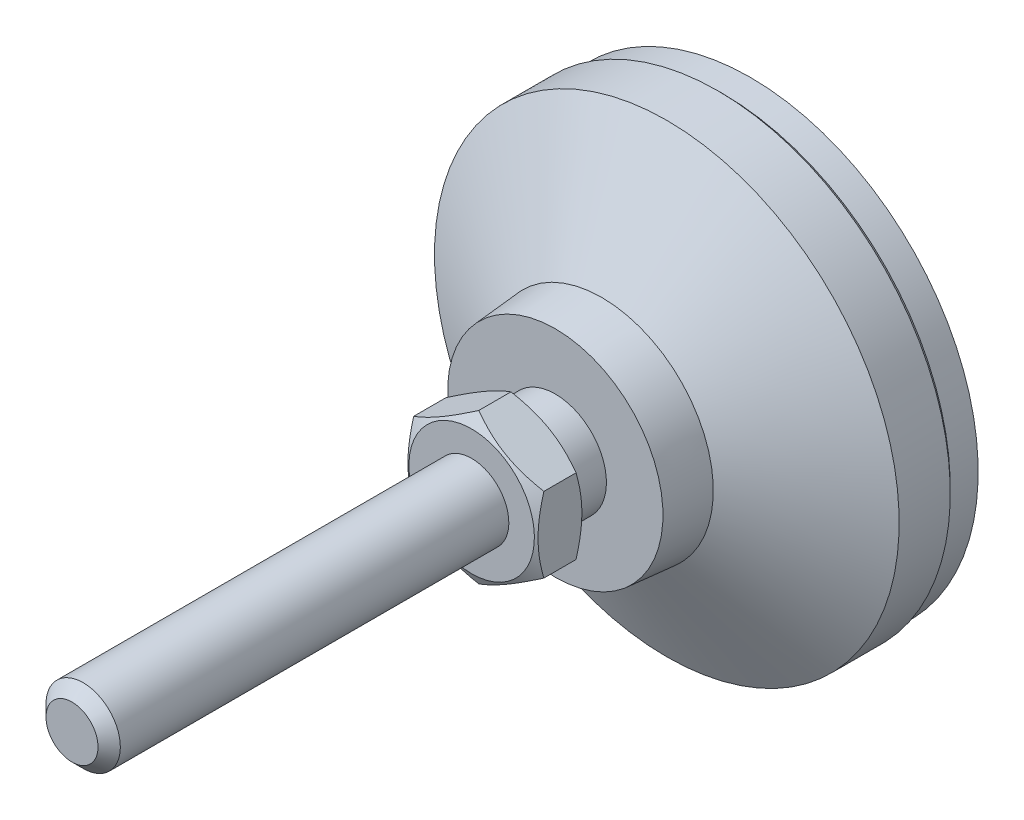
ISO-10303-21;
HEADER;
FILE_DESCRIPTION(('STEP AP214'),'2;1');
FILE_NAME('part.step','',(''),(''),'','','');
FILE_SCHEMA(('AUTOMOTIVE_DESIGN { 1 0 10303 214 1 1 1 1 }'));
ENDSEC;
DATA;
#1=APPLICATION_CONTEXT('core data for automotive mechanical design processes');
#2=APPLICATION_PROTOCOL_DEFINITION('international standard','automotive_design',2000,#1);
#3=PRODUCT_CONTEXT('',#1,'mechanical');
#4=PRODUCT('Part','Part','',(#3));
#5=PRODUCT_RELATED_PRODUCT_CATEGORY('part','',(#4));
#6=PRODUCT_DEFINITION_FORMATION('','',#4);
#7=PRODUCT_DEFINITION_CONTEXT('part definition',#1,'design');
#8=PRODUCT_DEFINITION('design','',#6,#7);
#9=PRODUCT_DEFINITION_SHAPE('','',#8);
#10=(LENGTH_UNIT() NAMED_UNIT(*) SI_UNIT(.MILLI.,.METRE.));
#11=(NAMED_UNIT(*) PLANE_ANGLE_UNIT() SI_UNIT($,.RADIAN.));
#12=(NAMED_UNIT(*) SI_UNIT($,.STERADIAN.) SOLID_ANGLE_UNIT());
#13=UNCERTAINTY_MEASURE_WITH_UNIT(LENGTH_MEASURE(1.E-05),#10,'distance_accuracy_value','');
#14=(GEOMETRIC_REPRESENTATION_CONTEXT(3) GLOBAL_UNCERTAINTY_ASSIGNED_CONTEXT((#13)) GLOBAL_UNIT_ASSIGNED_CONTEXT((#10,
#11,#12)) REPRESENTATION_CONTEXT('',''));
#15=CARTESIAN_POINT('',(0.,0.,0.));
#16=DIRECTION('',(0.,0.,1.));
#17=DIRECTION('',(1.,0.,0.));
#18=AXIS2_PLACEMENT_3D('',#15,#16,#17);
#19=CARTESIAN_POINT('',(0.,0.,2.));
#20=DIRECTION('',(0.,0.,-1.));
#21=DIRECTION('',(0.,1.,0.));
#22=AXIS2_PLACEMENT_3D('',#19,#20,#21);
#23=CYLINDRICAL_SURFACE('',#22,5.49999999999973);
#24=CARTESIAN_POINT('',(0.,0.,25.));
#25=DIRECTION('',(0.,0.,-1.));
#26=DIRECTION('',(0.,1.,0.));
#27=AXIS2_PLACEMENT_3D('',#24,#25,#26);
#28=CIRCLE('',#27,5.49999999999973);
#29=CARTESIAN_POINT('',(0.,5.49999999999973,25.));
#30=VERTEX_POINT('',#29);
#31=EDGE_CURVE('E106',#30,#30,#28,.T.);
#32=ORIENTED_EDGE('',*,*,#31,.T.);
#33=EDGE_LOOP('',(#32));
#34=FACE_BOUND('',#33,.T.);
#35=CARTESIAN_POINT('',(0.,0.,21.));
#36=DIRECTION('',(0.,0.,-1.));
#37=DIRECTION('',(0.,1.,0.));
#38=AXIS2_PLACEMENT_3D('',#35,#36,#37);
#39=CIRCLE('',#38,5.49999999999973);
#40=CARTESIAN_POINT('',(0.,5.49999999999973,21.));
#41=VERTEX_POINT('',#40);
#42=EDGE_CURVE('E93',#41,#41,#39,.T.);
#43=ORIENTED_EDGE('',*,*,#42,.F.);
#44=EDGE_LOOP('',(#43));
#45=FACE_BOUND('',#44,.T.);
#46=ADVANCED_FACE('F14',(#34,#45),#23,.T.);
#47=CARTESIAN_POINT('',(-5.49999999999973,0.,25.));
#48=DIRECTION('',(0.,0.,1.));
#49=DIRECTION('',(0.,-1.,0.));
#50=AXIS2_PLACEMENT_3D('',#47,#48,#49);
#51=PLANE('',#50);
#52=CARTESIAN_POINT('',(0.,0.,25.));
#53=DIRECTION('',(0.,0.,1.));
#54=DIRECTION('',(0.,-1.,0.));
#55=AXIS2_PLACEMENT_3D('',#52,#53,#54);
#56=CIRCLE('',#55,6.75);
#57=CARTESIAN_POINT('',(0.,-6.75,25.));
#58=VERTEX_POINT('',#57);
#59=EDGE_CURVE('E398',#58,#58,#56,.T.);
#60=ORIENTED_EDGE('',*,*,#59,.F.);
#61=EDGE_LOOP('',(#60));
#62=FACE_BOUND('',#61,.T.);
#63=ORIENTED_EDGE('',*,*,#31,.F.);
#64=EDGE_LOOP('',(#63));
#65=FACE_BOUND('',#64,.T.);
#66=ADVANCED_FACE('F143',(#62,#65),#51,.F.);
#67=CARTESIAN_POINT('',(0.,-5.49999999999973,21.));
#68=DIRECTION('',(0.,0.,1.));
#69=DIRECTION('',(0.,-1.,0.));
#70=AXIS2_PLACEMENT_3D('',#67,#68,#69);
#71=PLANE('',#70);
#72=ORIENTED_EDGE('',*,*,#42,.T.);
#73=EDGE_LOOP('',(#72));
#74=FACE_BOUND('',#73,.T.);
#75=CARTESIAN_POINT('',(0.,0.,21.));
#76=DIRECTION('',(0.,0.,1.));
#77=DIRECTION('',(0.,-1.,0.));
#78=AXIS2_PLACEMENT_3D('',#75,#76,#77);
#79=CIRCLE('',#78,11.5833333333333);
#80=CARTESIAN_POINT('',(0.,-11.5833333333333,21.));
#81=VERTEX_POINT('',#80);
#82=EDGE_CURVE('E88',#81,#81,#79,.T.);
#83=ORIENTED_EDGE('',*,*,#82,.T.);
#84=EDGE_LOOP('',(#83));
#85=FACE_BOUND('',#84,.T.);
#86=ADVANCED_FACE('F150',(#74,#85),#71,.T.);
#87=CARTESIAN_POINT('',(0.,0.,2.));
#88=DIRECTION('',(0.,0.,-1.));
#89=DIRECTION('',(0.,1.,0.));
#90=AXIS2_PLACEMENT_3D('',#87,#88,#89);
#91=CYLINDRICAL_SURFACE('',#90,25.);
#92=CARTESIAN_POINT('',(0.,0.,3.5));
#93=DIRECTION('',(0.,0.,-1.));
#94=DIRECTION('',(0.,1.,0.));
#95=AXIS2_PLACEMENT_3D('',#92,#93,#94);
#96=CIRCLE('',#95,25.);
#97=CARTESIAN_POINT('',(0.,25.,3.5));
#98=VERTEX_POINT('',#97);
#99=EDGE_CURVE('E28',#98,#98,#96,.F.);
#100=ORIENTED_EDGE('',*,*,#99,.T.);
#101=EDGE_LOOP('',(#100));
#102=FACE_BOUND('',#101,.T.);
#103=CARTESIAN_POINT('',(0.,0.,9.));
#104=DIRECTION('',(0.,0.,-1.));
#105=DIRECTION('',(0.,1.,0.));
#106=AXIS2_PLACEMENT_3D('',#103,#104,#105);
#107=CIRCLE('',#106,25.);
#108=CARTESIAN_POINT('',(0.,25.,9.));
#109=VERTEX_POINT('',#108);
#110=EDGE_CURVE('E112',#109,#109,#107,.T.);
#111=ORIENTED_EDGE('',*,*,#110,.T.);
#112=EDGE_LOOP('',(#111));
#113=FACE_BOUND('',#112,.T.);
#114=ADVANCED_FACE('F120',(#102,#113),#91,.T.);
#115=CARTESIAN_POINT('',(0.,0.,16.));
#116=DIRECTION('',(0.,0.,-1.));
#117=DIRECTION('',(0.,1.,0.));
#118=AXIS2_PLACEMENT_3D('',#115,#116,#117);
#119=CONICAL_SURFACE('',#118,12.,1.07685495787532);
#120=ORIENTED_EDGE('',*,*,#110,.F.);
#121=EDGE_LOOP('',(#120));
#122=FACE_BOUND('',#121,.T.);
#123=CARTESIAN_POINT('',(0.,0.,16.));
#124=DIRECTION('',(0.,0.,-1.));
#125=DIRECTION('',(0.,1.,0.));
#126=AXIS2_PLACEMENT_3D('',#123,#124,#125);
#127=CIRCLE('',#126,12.);
#128=CARTESIAN_POINT('',(0.,12.,16.));
#129=VERTEX_POINT('',#128);
#130=EDGE_CURVE('E109',#129,#129,#127,.T.);
#131=ORIENTED_EDGE('',*,*,#130,.T.);
#132=EDGE_LOOP('',(#131));
#133=FACE_BOUND('',#132,.T.);
#134=ADVANCED_FACE('F158',(#122,#133),#119,.T.);
#135=CARTESIAN_POINT('',(0.,0.,22.));
#136=DIRECTION('',(0.,0.,-1.));
#137=DIRECTION('',(0.,1.,0.));
#138=AXIS2_PLACEMENT_3D('',#135,#136,#137);
#139=CONICAL_SURFACE('',#138,11.5,0.0831412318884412);
#140=ORIENTED_EDGE('',*,*,#130,.F.);
#141=EDGE_LOOP('',(#140));
#142=FACE_BOUND('',#141,.T.);
#143=ORIENTED_EDGE('',*,*,#82,.F.);
#144=EDGE_LOOP('',(#143));
#145=FACE_BOUND('',#144,.T.);
#146=ADVANCED_FACE('F126',(#142,#145),#139,.T.);
#147=CARTESIAN_POINT('',(0.,0.,3.));
#148=DIRECTION('',(0.,0.,1.));
#149=DIRECTION('',(0.,-1.,0.));
#150=AXIS2_PLACEMENT_3D('',#147,#148,#149);
#151=CONICAL_SURFACE('',#150,24.5,0.785398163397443);
#152=ORIENTED_EDGE('',*,*,#99,.F.);
#153=EDGE_LOOP('',(#152));
#154=FACE_BOUND('',#153,.T.);
#155=CARTESIAN_POINT('',(0.,0.,3.));
#156=DIRECTION('',(0.,0.,-1.));
#157=DIRECTION('',(0.,1.,0.));
#158=AXIS2_PLACEMENT_3D('',#155,#156,#157);
#159=CIRCLE('',#158,24.5);
#160=CARTESIAN_POINT('',(0.,24.5,3.));
#161=VERTEX_POINT('',#160);
#162=EDGE_CURVE('E114',#161,#161,#159,.T.);
#163=ORIENTED_EDGE('',*,*,#162,.F.);
#164=EDGE_LOOP('',(#163));
#165=FACE_BOUND('',#164,.T.);
#166=ADVANCED_FACE('F16',(#154,#165),#151,.T.);
#167=CARTESIAN_POINT('',(0.,0.,0.));
#168=DIRECTION('',(0.,0.,1.));
#169=DIRECTION('',(0.,-1.,0.));
#170=AXIS2_PLACEMENT_3D('',#167,#168,#169);
#171=CYLINDRICAL_SURFACE('',#170,24.5);
#172=CARTESIAN_POINT('',(0.,0.,0.));
#173=DIRECTION('',(0.,0.,-1.));
#174=DIRECTION('',(0.,1.,0.));
#175=AXIS2_PLACEMENT_3D('',#172,#173,#174);
#176=CIRCLE('',#175,24.5);
#177=CARTESIAN_POINT('',(0.,24.5,0.));
#178=VERTEX_POINT('',#177);
#179=EDGE_CURVE('E264',#178,#178,#176,.T.);
#180=ORIENTED_EDGE('',*,*,#179,.F.);
#181=EDGE_LOOP('',(#180));
#182=FACE_BOUND('',#181,.T.);
#183=ORIENTED_EDGE('',*,*,#162,.T.);
#184=EDGE_LOOP('',(#183));
#185=FACE_BOUND('',#184,.T.);
#186=ADVANCED_FACE('F125',(#182,#185),#171,.T.);
#187=CARTESIAN_POINT('',(0.,0.,0.));
#188=DIRECTION('',(0.,0.,-1.));
#189=DIRECTION('',(0.,1.,0.));
#190=AXIS2_PLACEMENT_3D('',#187,#188,#189);
#191=PLANE('',#190);
#192=ORIENTED_EDGE('',*,*,#179,.T.);
#193=EDGE_LOOP('',(#192));
#194=FACE_BOUND('',#193,.T.);
#195=ADVANCED_FACE('F130',(#194),#191,.T.);
#196=CARTESIAN_POINT('',(0.,0.,25.));
#197=DIRECTION('',(0.,0.,1.));
#198=DIRECTION('',(0.,-1.,0.));
#199=AXIS2_PLACEMENT_3D('',#196,#197,#198);
#200=CONICAL_SURFACE('',#199,6.75,1.0471975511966);
#201=CARTESIAN_POINT('',(0.000200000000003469,-8.0830192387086,25.7696190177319));
#202=CARTESIAN_POINT('',(-0.15366790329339,-7.99418356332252,25.7183374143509));
#203=CARTESIAN_POINT('',(-0.308109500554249,-7.90501666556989,25.669383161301));
#204=CARTESIAN_POINT('',(-0.618246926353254,-7.72595873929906,25.5767703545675));
#205=CARTESIAN_POINT('',(-0.773943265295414,-7.63606741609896,25.5331140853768));
#206=CARTESIAN_POINT('',(-1.24352516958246,-7.36495417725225,25.4109491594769));
#207=CARTESIAN_POINT('',(-1.5592643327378,-7.18266208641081,25.3414631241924));
#208=CARTESIAN_POINT('',(-2.03176224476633,-6.90986528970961,25.2599825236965));
#209=CARTESIAN_POINT('',(-2.18710922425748,-6.82017566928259,25.2367710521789));
#210=CARTESIAN_POINT('',(-2.49850511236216,-6.64039116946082,25.1978487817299));
#211=CARTESIAN_POINT('',(-2.6545539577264,-6.55029632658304,25.1821373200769));
#212=CARTESIAN_POINT('',(-2.96692267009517,-6.36995016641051,25.1586154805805));
#213=CARTESIAN_POINT('',(-3.12324202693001,-6.27969914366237,25.1507961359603));
#214=CARTESIAN_POINT('',(-3.43601650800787,-6.09911871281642,25.1432178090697));
#215=CARTESIAN_POINT('',(-3.59247162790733,-6.00878930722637,25.1434585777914));
#216=CARTESIAN_POINT('',(-4.02110687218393,-5.76131663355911,25.155197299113));
#217=CARTESIAN_POINT('',(-4.29314668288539,-5.60425437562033,25.1749033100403));
#218=CARTESIAN_POINT('',(-4.83541944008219,-5.29117305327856,25.2373910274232));
#219=CARTESIAN_POINT('',(-5.10565047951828,-5.13515508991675,25.2801940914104));
#220=CARTESIAN_POINT('',(-5.64901454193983,-4.82144370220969,25.3871892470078));
#221=CARTESIAN_POINT('',(-5.92207900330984,-4.6637898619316,25.4518346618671));
#222=CARTESIAN_POINT('',(-6.46413578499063,-4.35083323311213,25.5985536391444));
#223=CARTESIAN_POINT('',(-6.73313504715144,-4.19552643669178,25.680592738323));
#224=CARTESIAN_POINT('',(-7.0002,-4.04133641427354,25.7696190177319));
#225=B_SPLINE_CURVE_WITH_KNOTS('',3,(#201,#202,#203,#204,#205,#206,#207,#208,#209,#210,#211,
#212,#213,#214,#215,#216,#217,#218,#219,#220,#221,#222,#223,#224),.UNSPECIFIED.,.F.,.F.,(4,2,2,
2,2,2,2,2,2,2,2,4),(0.,0.554727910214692,1.10969417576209,2.2219327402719,2.76443041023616,
3.30688013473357,3.84871284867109,4.39052882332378,5.33376515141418,6.27787517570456,
7.2429241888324,8.20607866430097),.UNSPECIFIED.);
#226=CARTESIAN_POINT('',(0.,-8.08290376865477,25.7695523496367));
#227=VERTEX_POINT('',#226);
#228=CARTESIAN_POINT('',(-7.,-4.04145188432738,25.7695523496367));
#229=VERTEX_POINT('',#228);
#230=EDGE_CURVE('E73',#227,#229,#225,.T.);
#231=ORIENTED_EDGE('',*,*,#230,.T.);
#232=CARTESIAN_POINT('',(-7.,10.8727518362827,28.5687353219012));
#233=CARTESIAN_POINT('',(-7.,10.5668728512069,28.4202886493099));
#234=CARTESIAN_POINT('',(-7.,10.2602935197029,28.273260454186));
#235=CARTESIAN_POINT('',(-7.,9.64536177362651,27.9828384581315));
#236=CARTESIAN_POINT('',(-7.,9.33700909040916,27.8394452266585));
#237=CARTESIAN_POINT('',(-7.,8.71657765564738,27.5563728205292));
#238=CARTESIAN_POINT('',(-7.,8.40448776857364,27.4167179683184));
#239=CARTESIAN_POINT('',(-7.,7.77783170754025,27.1431008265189));
#240=CARTESIAN_POINT('',(-7.,7.46326565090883,27.009138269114));
#241=CARTESIAN_POINT('',(-7.,6.8209391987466,26.7441935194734));
#242=CARTESIAN_POINT('',(-7.,6.49308086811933,26.6134474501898));
#243=CARTESIAN_POINT('',(-7.,5.83353553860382,26.3618096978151));
#244=CARTESIAN_POINT('',(-7.,5.50184811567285,26.24091911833));
#245=CARTESIAN_POINT('',(-7.,4.83472824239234,26.0121538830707));
#246=CARTESIAN_POINT('',(-7.,4.49930487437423,25.9042530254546));
#247=CARTESIAN_POINT('',(-7.,3.82365861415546,25.7049170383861));
#248=CARTESIAN_POINT('',(-7.,3.48343726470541,25.6134767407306));
#249=CARTESIAN_POINT('',(-7.,2.79983674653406,25.4519320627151));
#250=CARTESIAN_POINT('',(-7.,2.45648582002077,25.3817113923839));
#251=CARTESIAN_POINT('',(-7.,1.9383188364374,25.2953265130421));
#252=CARTESIAN_POINT('',(-7.,1.76506028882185,25.2696880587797));
#253=CARTESIAN_POINT('',(-7.,1.41767705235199,25.2252291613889));
#254=CARTESIAN_POINT('',(-7.,1.24355245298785,25.2064080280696));
#255=CARTESIAN_POINT('',(-7.,0.896951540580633,25.1761954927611));
#256=CARTESIAN_POINT('',(-7.,0.724483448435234,25.1647101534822));
#257=CARTESIAN_POINT('',(-7.,0.379216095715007,25.1490439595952));
#258=CARTESIAN_POINT('',(-7.,0.206416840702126,25.1448629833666));
#259=CARTESIAN_POINT('',(-7.,-0.139203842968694,25.143905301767));
#260=CARTESIAN_POINT('',(-7.,-0.31202527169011,25.147128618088));
#261=CARTESIAN_POINT('',(-7.,-0.657378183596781,25.1609005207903));
#262=CARTESIAN_POINT('',(-7.,-0.829909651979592,25.1714494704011));
#263=CARTESIAN_POINT('',(-7.,-1.24403831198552,25.2053386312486));
#264=CARTESIAN_POINT('',(-7.,-1.4853594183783,25.232125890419));
#265=CARTESIAN_POINT('',(-7.,-1.96621035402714,25.2985745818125));
#266=CARTESIAN_POINT('',(-7.,-2.20573993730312,25.3382377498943));
#267=CARTESIAN_POINT('',(-7.,-2.92136746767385,25.4744379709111));
#268=CARTESIAN_POINT('',(-7.,-3.39423778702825,25.5881610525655));
#269=CARTESIAN_POINT('',(-7.,-4.10133246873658,25.7853717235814));
#270=CARTESIAN_POINT('',(-7.,-4.33922419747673,25.8564663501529));
#271=CARTESIAN_POINT('',(-7.,-4.8126971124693,26.0060412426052));
#272=CARTESIAN_POINT('',(-7.,-5.04827828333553,26.0845215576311));
#273=CARTESIAN_POINT('',(-7.,-5.51720419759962,26.2476084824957));
#274=CARTESIAN_POINT('',(-7.,-5.75054964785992,26.3322130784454));
#275=CARTESIAN_POINT('',(-7.,-6.21530702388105,26.5065529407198));
#276=CARTESIAN_POINT('',(-7.,-6.44671897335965,26.5962881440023));
#277=CARTESIAN_POINT('',(-7.,-6.99710442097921,26.8156150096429));
#278=CARTESIAN_POINT('',(-7.,-7.31528785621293,26.9471857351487));
#279=CARTESIAN_POINT('',(-7.,-7.94891381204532,27.2167885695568));
#280=CARTESIAN_POINT('',(-7.,-8.26435615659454,27.3548210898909));
#281=CARTESIAN_POINT('',(-7.,-8.89301065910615,27.6360358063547));
#282=CARTESIAN_POINT('',(-7.,-9.20622233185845,27.7792190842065));
#283=CARTESIAN_POINT('',(-7.,-9.83073866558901,28.0696932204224));
#284=CARTESIAN_POINT('',(-7.,-10.1420432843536,28.2169841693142));
#285=CARTESIAN_POINT('',(-7.,-10.7633969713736,28.5150557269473));
#286=CARTESIAN_POINT('',(-7.,-11.0734442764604,28.6658400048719));
#287=CARTESIAN_POINT('',(-7.,-11.6921951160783,28.9701434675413));
#288=CARTESIAN_POINT('',(-7.,-12.0008986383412,29.1236626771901));
#289=CARTESIAN_POINT('',(-7.,-12.9252323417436,29.5875456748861));
#290=CARTESIAN_POINT('',(-7.,-13.5391723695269,29.9012767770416));
#291=CARTESIAN_POINT('',(-7.,-14.7116016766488,30.5080255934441));
#292=CARTESIAN_POINT('',(-7.,-15.2703577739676,30.8005300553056));
#293=CARTESIAN_POINT('',(-7.,-16.3858007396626,31.3895048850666));
#294=CARTESIAN_POINT('',(-7.,-16.9424875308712,31.6859753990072));
#295=CARTESIAN_POINT('',(-7.,-18.0528275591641,32.28116907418));
#296=CARTESIAN_POINT('',(-7.,-18.606484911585,32.5798845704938));
#297=CARTESIAN_POINT('',(-7.,-19.7124793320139,33.1796764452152));
#298=CARTESIAN_POINT('',(-7.,-20.2648164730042,33.4807526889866));
#299=CARTESIAN_POINT('',(-7.,-20.8166691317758,33.7827084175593));
#300=B_SPLINE_CURVE_WITH_KNOTS('',3,(#232,#233,#234,#235,#236,#237,#238,#239,#240,#241,#242,
#243,#244,#245,#246,#247,#248,#249,#250,#251,#252,#253,#254,#255,#256,#257,#258,#259,#260,#261,
#262,#263,#264,#265,#266,#267,#268,#269,#270,#271,#272,#273,#274,#275,#276,#277,#278,#279,#280,
#281,#282,#283,#284,#285,#286,#287,#288,#289,#290,#291,#292,#293,#294,#295,#296,#297,#298,#299),
.UNSPECIFIED.,.F.,.F.,(4,2,2,2,2,2,2,2,2,2,2,2,2,2,2,2,2,2,2,2,2,2,2,2,2,2,2,2,2,2,2,2,2,4),(0.,
1.02000517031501,2.04016916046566,3.06585854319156,4.09149961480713,5.15027729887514,
6.20917338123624,7.26589642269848,8.32228709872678,9.37277881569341,9.89810152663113,
10.4233710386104,10.9417718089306,11.4601639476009,11.9785576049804,12.496976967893,
13.2249757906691,13.9530727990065,15.4100658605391,16.1548674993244,16.8996740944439,
17.6442368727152,18.3887905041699,19.4216330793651,20.4545415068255,21.4876681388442,
22.5208175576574,23.5551063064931,24.5894044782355,26.6577118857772,28.5497586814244,
30.4418753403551,32.329170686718,34.2163591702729),.UNSPECIFIED.);
#301=CARTESIAN_POINT('',(-7.,4.04145188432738,25.7695523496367));
#302=VERTEX_POINT('',#301);
#303=EDGE_CURVE('E81',#229,#302,#300,.F.);
#304=ORIENTED_EDGE('',*,*,#303,.T.);
#305=CARTESIAN_POINT('',(-7.0002,4.04133641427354,25.7696190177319));
#306=CARTESIAN_POINT('',(-6.84633209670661,4.13017208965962,25.7183374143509));
#307=CARTESIAN_POINT('',(-6.69189049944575,4.21933898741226,25.669383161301));
#308=CARTESIAN_POINT('',(-6.38175307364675,4.39839691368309,25.5767703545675));
#309=CARTESIAN_POINT('',(-6.22605673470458,4.48828823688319,25.5331140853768));
#310=CARTESIAN_POINT('',(-5.75647483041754,4.75940147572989,25.4109491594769));
#311=CARTESIAN_POINT('',(-5.4407356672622,4.94169356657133,25.3414631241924));
#312=CARTESIAN_POINT('',(-4.96823775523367,5.21449036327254,25.2599825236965));
#313=CARTESIAN_POINT('',(-4.81289077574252,5.30417998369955,25.2367710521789));
#314=CARTESIAN_POINT('',(-4.50149488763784,5.48396448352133,25.1978487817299));
#315=CARTESIAN_POINT('',(-4.34544604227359,5.57405932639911,25.1821373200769));
#316=CARTESIAN_POINT('',(-4.03307732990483,5.75440548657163,25.1586154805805));
#317=CARTESIAN_POINT('',(-3.87675797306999,5.84465650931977,25.1507961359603));
#318=CARTESIAN_POINT('',(-3.56398349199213,6.02523694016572,25.1432178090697));
#319=CARTESIAN_POINT('',(-3.40752837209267,6.11556634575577,25.1434585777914));
#320=CARTESIAN_POINT('',(-2.97889312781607,6.36303901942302,25.155197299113));
#321=CARTESIAN_POINT('',(-2.7068533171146,6.52010127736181,25.1749033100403));
#322=CARTESIAN_POINT('',(-2.16458055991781,6.83318259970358,25.2373910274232));
#323=CARTESIAN_POINT('',(-1.89434952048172,6.9892005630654,25.2801940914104));
#324=CARTESIAN_POINT('',(-1.35098545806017,7.30291195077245,25.3871892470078));
#325=CARTESIAN_POINT('',(-1.07792099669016,7.46056579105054,25.4518346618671));
#326=CARTESIAN_POINT('',(-0.535864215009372,7.77352241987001,25.5985536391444));
#327=CARTESIAN_POINT('',(-0.266864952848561,7.92882921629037,25.680592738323));
#328=CARTESIAN_POINT('',(0.000199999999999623,8.0830192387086,25.7696190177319));
#329=B_SPLINE_CURVE_WITH_KNOTS('',3,(#305,#306,#307,#308,#309,#310,#311,#312,#313,#314,#315,
#316,#317,#318,#319,#320,#321,#322,#323,#324,#325,#326,#327,#328),.UNSPECIFIED.,.F.,.F.,(4,2,2,
2,2,2,2,2,2,2,2,4),(0.,0.554727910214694,1.10969417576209,2.2219327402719,2.76443041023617,
3.30688013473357,3.84871284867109,4.39052882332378,5.33376515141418,6.27787517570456,
7.2429241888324,8.20607866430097),.UNSPECIFIED.);
#330=CARTESIAN_POINT('',(0.,8.08290376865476,25.7695523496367));
#331=VERTEX_POINT('',#330);
#332=EDGE_CURVE('E198',#302,#331,#329,.T.);
#333=ORIENTED_EDGE('',*,*,#332,.T.);
#334=CARTESIAN_POINT('',(-0.000200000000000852,8.0830192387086,25.7696190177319));
#335=CARTESIAN_POINT('',(0.153667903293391,7.99418356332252,25.7183374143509));
#336=CARTESIAN_POINT('',(0.30810950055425,7.90501666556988,25.669383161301));
#337=CARTESIAN_POINT('',(0.618246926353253,7.72595873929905,25.5767703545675));
#338=CARTESIAN_POINT('',(0.773943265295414,7.63606741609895,25.5331140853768));
#339=CARTESIAN_POINT('',(1.24352516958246,7.36495417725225,25.4109491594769));
#340=CARTESIAN_POINT('',(1.5592643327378,7.18266208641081,25.3414631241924));
#341=CARTESIAN_POINT('',(2.03176224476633,6.9098652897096,25.2599825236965));
#342=CARTESIAN_POINT('',(2.18710922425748,6.82017566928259,25.2367710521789));
#343=CARTESIAN_POINT('',(2.49850511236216,6.64039116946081,25.1978487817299));
#344=CARTESIAN_POINT('',(2.65455395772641,6.55029632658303,25.1821373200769));
#345=CARTESIAN_POINT('',(2.96692267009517,6.36995016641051,25.1586154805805));
#346=CARTESIAN_POINT('',(3.12324202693,6.27969914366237,25.1507961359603));
#347=CARTESIAN_POINT('',(3.43601650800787,6.09911871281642,25.1432178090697));
#348=CARTESIAN_POINT('',(3.59247162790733,6.00878930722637,25.1434585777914));
#349=CARTESIAN_POINT('',(4.02110687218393,5.76131663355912,25.155197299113));
#350=CARTESIAN_POINT('',(4.2931466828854,5.60425437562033,25.1749033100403));
#351=CARTESIAN_POINT('',(4.83541944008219,5.29117305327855,25.2373910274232));
#352=CARTESIAN_POINT('',(5.10565047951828,5.13515508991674,25.2801940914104));
#353=CARTESIAN_POINT('',(5.64901454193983,4.82144370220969,25.3871892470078));
#354=CARTESIAN_POINT('',(5.92207900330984,4.66378986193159,25.4518346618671));
#355=CARTESIAN_POINT('',(6.46413578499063,4.35083323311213,25.5985536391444));
#356=CARTESIAN_POINT('',(6.73313504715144,4.19552643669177,25.680592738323));
#357=CARTESIAN_POINT('',(7.0002,4.04133641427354,25.7696190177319));
#358=B_SPLINE_CURVE_WITH_KNOTS('',3,(#334,#335,#336,#337,#338,#339,#340,#341,#342,#343,#344,
#345,#346,#347,#348,#349,#350,#351,#352,#353,#354,#355,#356,#357),.UNSPECIFIED.,.F.,.F.,(4,2,2,
2,2,2,2,2,2,2,2,4),(0.,0.554727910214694,1.10969417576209,2.2219327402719,2.76443041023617,
3.30688013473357,3.84871284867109,4.39052882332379,5.33376515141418,6.27787517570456,
7.2429241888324,8.20607866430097),.UNSPECIFIED.);
#359=CARTESIAN_POINT('',(7.,4.04145188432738,25.7695523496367));
#360=VERTEX_POINT('',#359);
#361=EDGE_CURVE('E227',#331,#360,#358,.T.);
#362=ORIENTED_EDGE('',*,*,#361,.T.);
#363=CARTESIAN_POINT('',(7.,10.8727518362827,28.5687353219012));
#364=CARTESIAN_POINT('',(7.,10.5668728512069,28.4202886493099));
#365=CARTESIAN_POINT('',(7.,10.2602935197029,28.273260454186));
#366=CARTESIAN_POINT('',(7.,9.64536177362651,27.9828384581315));
#367=CARTESIAN_POINT('',(7.,9.33700909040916,27.8394452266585));
#368=CARTESIAN_POINT('',(7.,8.71657765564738,27.5563728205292));
#369=CARTESIAN_POINT('',(7.,8.40448776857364,27.4167179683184));
#370=CARTESIAN_POINT('',(7.,7.77783170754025,27.1431008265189));
#371=CARTESIAN_POINT('',(7.,7.46326565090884,27.009138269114));
#372=CARTESIAN_POINT('',(7.,6.8209391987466,26.7441935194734));
#373=CARTESIAN_POINT('',(7.,6.49308086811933,26.6134474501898));
#374=CARTESIAN_POINT('',(7.,5.83353553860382,26.3618096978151));
#375=CARTESIAN_POINT('',(7.,5.50184811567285,26.24091911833));
#376=CARTESIAN_POINT('',(7.,4.83472824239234,26.0121538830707));
#377=CARTESIAN_POINT('',(7.,4.49930487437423,25.9042530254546));
#378=CARTESIAN_POINT('',(7.,3.82365861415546,25.7049170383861));
#379=CARTESIAN_POINT('',(7.,3.48343726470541,25.6134767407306));
#380=CARTESIAN_POINT('',(7.,2.79983674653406,25.4519320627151));
#381=CARTESIAN_POINT('',(7.,2.45648582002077,25.3817113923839));
#382=CARTESIAN_POINT('',(7.,1.9383188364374,25.2953265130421));
#383=CARTESIAN_POINT('',(7.,1.76506028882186,25.2696880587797));
#384=CARTESIAN_POINT('',(7.,1.41767705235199,25.2252291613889));
#385=CARTESIAN_POINT('',(7.,1.24355245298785,25.2064080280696));
#386=CARTESIAN_POINT('',(7.,0.896951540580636,25.1761954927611));
#387=CARTESIAN_POINT('',(7.,0.724483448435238,25.1647101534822));
#388=CARTESIAN_POINT('',(7.,0.379216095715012,25.1490439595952));
#389=CARTESIAN_POINT('',(7.,0.20641684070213,25.1448629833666));
#390=CARTESIAN_POINT('',(7.,-0.139203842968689,25.143905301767));
#391=CARTESIAN_POINT('',(7.,-0.312025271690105,25.147128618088));
#392=CARTESIAN_POINT('',(7.,-0.657378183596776,25.1609005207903));
#393=CARTESIAN_POINT('',(7.,-0.829909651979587,25.1714494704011));
#394=CARTESIAN_POINT('',(7.,-1.24403831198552,25.2053386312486));
#395=CARTESIAN_POINT('',(7.,-1.48535941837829,25.232125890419));
#396=CARTESIAN_POINT('',(7.,-1.96621035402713,25.2985745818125));
#397=CARTESIAN_POINT('',(7.,-2.20573993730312,25.3382377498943));
#398=CARTESIAN_POINT('',(7.,-2.92136746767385,25.4744379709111));
#399=CARTESIAN_POINT('',(7.,-3.39423778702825,25.5881610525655));
#400=CARTESIAN_POINT('',(7.,-4.10133246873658,25.7853717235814));
#401=CARTESIAN_POINT('',(7.,-4.33922419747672,25.8564663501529));
#402=CARTESIAN_POINT('',(7.,-4.8126971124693,26.0060412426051));
#403=CARTESIAN_POINT('',(7.,-5.04827828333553,26.0845215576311));
#404=CARTESIAN_POINT('',(7.,-5.51720419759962,26.2476084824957));
#405=CARTESIAN_POINT('',(7.,-5.75054964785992,26.3322130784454));
#406=CARTESIAN_POINT('',(7.,-6.21530702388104,26.5065529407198));
#407=CARTESIAN_POINT('',(7.,-6.44671897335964,26.5962881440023));
#408=CARTESIAN_POINT('',(7.,-6.9971044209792,26.8156150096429));
#409=CARTESIAN_POINT('',(7.,-7.31528785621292,26.9471857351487));
#410=CARTESIAN_POINT('',(7.,-7.94891381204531,27.2167885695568));
#411=CARTESIAN_POINT('',(7.,-8.26435615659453,27.3548210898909));
#412=CARTESIAN_POINT('',(7.,-8.89301065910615,27.6360358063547));
#413=CARTESIAN_POINT('',(7.,-9.20622233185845,27.7792190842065));
#414=CARTESIAN_POINT('',(7.,-9.830738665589,28.0696932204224));
#415=CARTESIAN_POINT('',(7.,-10.1420432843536,28.2169841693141));
#416=CARTESIAN_POINT('',(7.,-10.7633969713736,28.5150557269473));
#417=CARTESIAN_POINT('',(7.,-11.0734442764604,28.6658400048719));
#418=CARTESIAN_POINT('',(7.,-11.6921951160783,28.9701434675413));
#419=CARTESIAN_POINT('',(7.,-12.0008986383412,29.1236626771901));
#420=CARTESIAN_POINT('',(7.,-12.9252323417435,29.5875456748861));
#421=CARTESIAN_POINT('',(7.,-13.5391723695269,29.9012767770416));
#422=CARTESIAN_POINT('',(7.,-14.7116016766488,30.508025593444));
#423=CARTESIAN_POINT('',(7.,-15.2703577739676,30.8005300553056));
#424=CARTESIAN_POINT('',(7.,-16.3858007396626,31.3895048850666));
#425=CARTESIAN_POINT('',(7.,-16.9424875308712,31.6859753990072));
#426=CARTESIAN_POINT('',(7.,-18.0528275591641,32.28116907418));
#427=CARTESIAN_POINT('',(7.,-18.606484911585,32.5798845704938));
#428=CARTESIAN_POINT('',(7.,-19.7124793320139,33.1796764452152));
#429=CARTESIAN_POINT('',(7.,-20.2648164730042,33.4807526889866));
#430=CARTESIAN_POINT('',(7.,-20.8166691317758,33.7827084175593));
#431=B_SPLINE_CURVE_WITH_KNOTS('',3,(#363,#364,#365,#366,#367,#368,#369,#370,#371,#372,#373,
#374,#375,#376,#377,#378,#379,#380,#381,#382,#383,#384,#385,#386,#387,#388,#389,#390,#391,#392,
#393,#394,#395,#396,#397,#398,#399,#400,#401,#402,#403,#404,#405,#406,#407,#408,#409,#410,#411,
#412,#413,#414,#415,#416,#417,#418,#419,#420,#421,#422,#423,#424,#425,#426,#427,#428,#429,#430),
.UNSPECIFIED.,.F.,.F.,(4,2,2,2,2,2,2,2,2,2,2,2,2,2,2,2,2,2,2,2,2,2,2,2,2,2,2,2,2,2,2,2,2,4),(0.,
1.02000517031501,2.04016916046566,3.06585854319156,4.09149961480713,5.15027729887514,
6.20917338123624,7.26589642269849,8.32228709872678,9.37277881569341,9.89810152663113,
10.4233710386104,10.9417718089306,11.4601639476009,11.9785576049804,12.496976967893,
13.2249757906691,13.9530727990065,15.4100658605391,16.1548674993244,16.8996740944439,
17.6442368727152,18.3887905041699,19.4216330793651,20.4545415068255,21.4876681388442,
22.5208175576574,23.5551063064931,24.5894044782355,26.6577118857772,28.5497586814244,
30.4418753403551,32.329170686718,34.2163591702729),.UNSPECIFIED.);
#432=CARTESIAN_POINT('',(7.,-4.04145188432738,25.7695523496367));
#433=VERTEX_POINT('',#432);
#434=EDGE_CURVE('E34',#360,#433,#431,.T.);
#435=ORIENTED_EDGE('',*,*,#434,.T.);
#436=CARTESIAN_POINT('',(7.0002,-4.04133641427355,25.7696190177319));
#437=CARTESIAN_POINT('',(6.84633209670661,-4.13017208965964,25.7183374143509));
#438=CARTESIAN_POINT('',(6.69189049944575,-4.21933898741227,25.669383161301));
#439=CARTESIAN_POINT('',(6.38175307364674,-4.3983969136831,25.5767703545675));
#440=CARTESIAN_POINT('',(6.22605673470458,-4.4882882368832,25.5331140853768));
#441=CARTESIAN_POINT('',(5.75647483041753,-4.7594014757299,25.4109491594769));
#442=CARTESIAN_POINT('',(5.4407356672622,-4.94169356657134,25.3414631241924));
#443=CARTESIAN_POINT('',(4.96823775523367,-5.21449036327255,25.2599825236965));
#444=CARTESIAN_POINT('',(4.81289077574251,-5.30417998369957,25.2367710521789));
#445=CARTESIAN_POINT('',(4.50149488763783,-5.48396448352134,25.1978487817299));
#446=CARTESIAN_POINT('',(4.34544604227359,-5.57405932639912,25.1821373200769));
#447=CARTESIAN_POINT('',(4.03307732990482,-5.75440548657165,25.1586154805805));
#448=CARTESIAN_POINT('',(3.87675797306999,-5.84465650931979,25.1507961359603));
#449=CARTESIAN_POINT('',(3.56398349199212,-6.02523694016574,25.1432178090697));
#450=CARTESIAN_POINT('',(3.40752837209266,-6.11556634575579,25.1434585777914));
#451=CARTESIAN_POINT('',(2.97889312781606,-6.36303901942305,25.155197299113));
#452=CARTESIAN_POINT('',(2.7068533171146,-6.52010127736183,25.1749033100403));
#453=CARTESIAN_POINT('',(2.1645805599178,-6.8331825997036,25.2373910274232));
#454=CARTESIAN_POINT('',(1.89434952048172,-6.98920056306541,25.2801940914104));
#455=CARTESIAN_POINT('',(1.35098545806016,-7.30291195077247,25.3871892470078));
#456=CARTESIAN_POINT('',(1.07792099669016,-7.46056579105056,25.4518346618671));
#457=CARTESIAN_POINT('',(0.535864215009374,-7.77352241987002,25.5985536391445));
#458=CARTESIAN_POINT('',(0.266864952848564,-7.92882921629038,25.680592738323));
#459=CARTESIAN_POINT('',(-0.000199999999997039,-8.08301923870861,25.7696190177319));
#460=B_SPLINE_CURVE_WITH_KNOTS('',3,(#436,#437,#438,#439,#440,#441,#442,#443,#444,#445,#446,
#447,#448,#449,#450,#451,#452,#453,#454,#455,#456,#457,#458,#459),.UNSPECIFIED.,.F.,.F.,(4,2,2,
2,2,2,2,2,2,2,2,4),(0.,0.554727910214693,1.10969417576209,2.2219327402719,2.76443041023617,
3.30688013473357,3.8487128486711,4.39052882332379,5.33376515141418,6.27787517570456,
7.2429241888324,8.20607866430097),.UNSPECIFIED.);
#461=EDGE_CURVE('E9',#433,#227,#460,.T.);
#462=ORIENTED_EDGE('',*,*,#461,.T.);
#463=EDGE_LOOP('',(#231,#304,#333,#362,#435,#462));
#464=FACE_BOUND('',#463,.T.);
#465=ORIENTED_EDGE('',*,*,#59,.T.);
#466=EDGE_LOOP('',(#465));
#467=FACE_BOUND('',#466,.T.);
#468=ADVANCED_FACE('F71',(#464,#467),#200,.T.);
#469=CARTESIAN_POINT('',(-2.79999999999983,0.,73.));
#470=DIRECTION('',(0.,0.,-1.));
#471=DIRECTION('',(0.,1.,0.));
#472=AXIS2_PLACEMENT_3D('',#469,#470,#471);
#473=PLANE('',#472);
#474=CARTESIAN_POINT('',(0.,0.,73.));
#475=DIRECTION('',(0.,0.,-1.));
#476=DIRECTION('',(0.,1.,0.));
#477=AXIS2_PLACEMENT_3D('',#474,#475,#476);
#478=CIRCLE('',#477,2.79999999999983);
#479=CARTESIAN_POINT('',(0.,2.79999999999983,73.));
#480=VERTEX_POINT('',#479);
#481=EDGE_CURVE('E97',#480,#480,#478,.T.);
#482=ORIENTED_EDGE('',*,*,#481,.F.);
#483=EDGE_LOOP('',(#482));
#484=FACE_BOUND('',#483,.T.);
#485=ADVANCED_FACE('F212',(#484),#473,.F.);
#486=CARTESIAN_POINT('',(0.,0.,73.));
#487=DIRECTION('',(0.,0.,-1.));
#488=DIRECTION('',(0.,1.,0.));
#489=AXIS2_PLACEMENT_3D('',#486,#487,#488);
#490=CONICAL_SURFACE('',#489,2.79999999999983,0.785398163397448);
#491=CARTESIAN_POINT('',(0.,0.,71.8));
#492=DIRECTION('',(0.,0.,-1.));
#493=DIRECTION('',(0.,1.,0.));
#494=AXIS2_PLACEMENT_3D('',#491,#492,#493);
#495=CIRCLE('',#494,3.99999999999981);
#496=CARTESIAN_POINT('',(0.,3.99999999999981,71.8));
#497=VERTEX_POINT('',#496);
#498=EDGE_CURVE('E100',#497,#497,#495,.T.);
#499=ORIENTED_EDGE('',*,*,#498,.F.);
#500=EDGE_LOOP('',(#499));
#501=FACE_BOUND('',#500,.T.);
#502=ORIENTED_EDGE('',*,*,#481,.T.);
#503=EDGE_LOOP('',(#502));
#504=FACE_BOUND('',#503,.T.);
#505=ADVANCED_FACE('F279',(#501,#504),#490,.T.);
#506=CARTESIAN_POINT('',(0.,0.,2.));
#507=DIRECTION('',(0.,0.,-1.));
#508=DIRECTION('',(0.,1.,0.));
#509=AXIS2_PLACEMENT_3D('',#506,#507,#508);
#510=CYLINDRICAL_SURFACE('',#509,3.99999999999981);
#511=CARTESIAN_POINT('',(0.,0.,30.));
#512=DIRECTION('',(0.,0.,-1.));
#513=DIRECTION('',(0.,1.,0.));
#514=AXIS2_PLACEMENT_3D('',#511,#512,#513);
#515=CIRCLE('',#514,3.99999999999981);
#516=CARTESIAN_POINT('',(0.,3.99999999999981,30.));
#517=VERTEX_POINT('',#516);
#518=EDGE_CURVE('E103',#517,#517,#515,.T.);
#519=ORIENTED_EDGE('',*,*,#518,.F.);
#520=EDGE_LOOP('',(#519));
#521=FACE_BOUND('',#520,.T.);
#522=ORIENTED_EDGE('',*,*,#498,.T.);
#523=EDGE_LOOP('',(#522));
#524=FACE_BOUND('',#523,.T.);
#525=ADVANCED_FACE('F283',(#521,#524),#510,.T.);
#526=CARTESIAN_POINT('',(-3.99999999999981,0.,30.));
#527=DIRECTION('',(0.,0.,-1.));
#528=DIRECTION('',(0.,1.,0.));
#529=AXIS2_PLACEMENT_3D('',#526,#527,#528);
#530=PLANE('',#529);
#531=CARTESIAN_POINT('',(0.,0.,30.));
#532=DIRECTION('',(0.,0.,1.));
#533=DIRECTION('',(0.,-1.,0.));
#534=AXIS2_PLACEMENT_3D('',#531,#532,#533);
#535=CIRCLE('',#534,6.75);
#536=CARTESIAN_POINT('',(0.,-6.75,30.));
#537=VERTEX_POINT('',#536);
#538=EDGE_CURVE('E80',#537,#537,#535,.T.);
#539=ORIENTED_EDGE('',*,*,#538,.T.);
#540=EDGE_LOOP('',(#539));
#541=FACE_BOUND('',#540,.T.);
#542=ORIENTED_EDGE('',*,*,#518,.T.);
#543=EDGE_LOOP('',(#542));
#544=FACE_BOUND('',#543,.T.);
#545=ADVANCED_FACE('F286',(#541,#544),#530,.F.);
#546=CARTESIAN_POINT('',(0.,0.,27.9796838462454));
#547=DIRECTION('',(0.,0.,-1.));
#548=DIRECTION('',(0.,1.,0.));
#549=AXIS2_PLACEMENT_3D('',#546,#547,#548);
#550=CONICAL_SURFACE('',#549,10.249290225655,1.0471975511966);
#551=CARTESIAN_POINT('',(-7.0002,-4.04133641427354,29.2303809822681));
#552=CARTESIAN_POINT('',(-6.84633209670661,-4.13017208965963,29.2816625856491));
#553=CARTESIAN_POINT('',(-6.69189049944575,-4.21933898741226,29.330616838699));
#554=CARTESIAN_POINT('',(-6.38175307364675,-4.3983969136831,29.4232296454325));
#555=CARTESIAN_POINT('',(-6.22605673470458,-4.48828823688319,29.4668859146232));
#556=CARTESIAN_POINT('',(-5.75647483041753,-4.7594014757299,29.5890508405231));
#557=CARTESIAN_POINT('',(-5.4407356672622,-4.94169356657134,29.6585368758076));
#558=CARTESIAN_POINT('',(-4.96823775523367,-5.21449036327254,29.7400174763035));
#559=CARTESIAN_POINT('',(-4.81289077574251,-5.30417998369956,29.7632289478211));
#560=CARTESIAN_POINT('',(-4.50149488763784,-5.48396448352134,29.8021512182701));
#561=CARTESIAN_POINT('',(-4.34544604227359,-5.57405932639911,29.8178626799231));
#562=CARTESIAN_POINT('',(-4.03307732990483,-5.75440548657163,29.8413845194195));
#563=CARTESIAN_POINT('',(-3.87675797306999,-5.84465650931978,29.8492038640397));
#564=CARTESIAN_POINT('',(-3.56398349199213,-6.02523694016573,29.8567821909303));
#565=CARTESIAN_POINT('',(-3.40752837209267,-6.11556634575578,29.8565414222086));
#566=CARTESIAN_POINT('',(-2.97889312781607,-6.36303901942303,29.844802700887));
#567=CARTESIAN_POINT('',(-2.7068533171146,-6.52010127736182,29.8250966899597));
#568=CARTESIAN_POINT('',(-2.1645805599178,-6.83318259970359,29.7626089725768));
#569=CARTESIAN_POINT('',(-1.89434952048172,-6.98920056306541,29.7198059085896));
#570=CARTESIAN_POINT('',(-1.35098545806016,-7.30291195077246,29.6128107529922));
#571=CARTESIAN_POINT('',(-1.07792099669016,-7.46056579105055,29.5481653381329));
#572=CARTESIAN_POINT('',(-0.53586421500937,-7.77352241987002,29.4014463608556));
#573=CARTESIAN_POINT('',(-0.266864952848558,-7.92882921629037,29.319407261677));
#574=CARTESIAN_POINT('',(0.000200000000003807,-8.0830192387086,29.2303809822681));
#575=B_SPLINE_CURVE_WITH_KNOTS('',3,(#551,#552,#553,#554,#555,#556,#557,#558,#559,#560,#561,
#562,#563,#564,#565,#566,#567,#568,#569,#570,#571,#572,#573,#574),.UNSPECIFIED.,.F.,.F.,(4,2,2,
2,2,2,2,2,2,2,2,4),(0.,0.554727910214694,1.10969417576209,2.2219327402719,2.76443041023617,
3.30688013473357,3.8487128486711,4.39052882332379,5.33376515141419,6.27787517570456,
7.2429241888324,8.20607866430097),.UNSPECIFIED.);
#576=CARTESIAN_POINT('',(-7.,-4.04145188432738,29.2304476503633));
#577=VERTEX_POINT('',#576);
#578=CARTESIAN_POINT('',(0.,-8.08290376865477,29.2304476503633));
#579=VERTEX_POINT('',#578);
#580=EDGE_CURVE('E263',#577,#579,#575,.T.);
#581=ORIENTED_EDGE('',*,*,#580,.T.);
#582=CARTESIAN_POINT('',(-0.000199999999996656,-8.08301923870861,29.2303809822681));
#583=CARTESIAN_POINT('',(0.153667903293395,-7.99418356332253,29.2816625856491));
#584=CARTESIAN_POINT('',(0.308109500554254,-7.90501666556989,29.330616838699));
#585=CARTESIAN_POINT('',(0.618246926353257,-7.72595873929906,29.4232296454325));
#586=CARTESIAN_POINT('',(0.773943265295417,-7.63606741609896,29.4668859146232));
#587=CARTESIAN_POINT('',(1.24352516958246,-7.36495417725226,29.5890508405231));
#588=CARTESIAN_POINT('',(1.5592643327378,-7.18266208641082,29.6585368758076));
#589=CARTESIAN_POINT('',(2.03176224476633,-6.90986528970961,29.7400174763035));
#590=CARTESIAN_POINT('',(2.18710922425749,-6.8201756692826,29.7632289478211));
#591=CARTESIAN_POINT('',(2.49850511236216,-6.64039116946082,29.8021512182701));
#592=CARTESIAN_POINT('',(2.65455395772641,-6.55029632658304,29.8178626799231));
#593=CARTESIAN_POINT('',(2.96692267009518,-6.36995016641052,29.8413845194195));
#594=CARTESIAN_POINT('',(3.12324202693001,-6.27969914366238,29.8492038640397));
#595=CARTESIAN_POINT('',(3.43601650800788,-6.09911871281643,29.8567821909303));
#596=CARTESIAN_POINT('',(3.59247162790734,-6.00878930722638,29.8565414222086));
#597=CARTESIAN_POINT('',(4.02110687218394,-5.76131663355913,29.844802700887));
#598=CARTESIAN_POINT('',(4.2931466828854,-5.60425437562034,29.8250966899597));
#599=CARTESIAN_POINT('',(4.8354194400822,-5.29117305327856,29.7626089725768));
#600=CARTESIAN_POINT('',(5.10565047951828,-5.13515508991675,29.7198059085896));
#601=CARTESIAN_POINT('',(5.64901454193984,-4.8214437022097,29.6128107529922));
#602=CARTESIAN_POINT('',(5.92207900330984,-4.6637898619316,29.5481653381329));
#603=CARTESIAN_POINT('',(6.46413578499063,-4.35083323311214,29.4014463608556));
#604=CARTESIAN_POINT('',(6.73313504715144,-4.19552643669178,29.319407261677));
#605=CARTESIAN_POINT('',(7.0002,-4.04133641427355,29.2303809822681));
#606=B_SPLINE_CURVE_WITH_KNOTS('',3,(#582,#583,#584,#585,#586,#587,#588,#589,#590,#591,#592,
#593,#594,#595,#596,#597,#598,#599,#600,#601,#602,#603,#604,#605),.UNSPECIFIED.,.F.,.F.,(4,2,2,
2,2,2,2,2,2,2,2,4),(0.,0.554727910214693,1.10969417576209,2.2219327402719,2.76443041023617,
3.30688013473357,3.8487128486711,4.39052882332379,5.33376515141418,6.27787517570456,
7.24292418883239,8.20607866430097),.UNSPECIFIED.);
#607=CARTESIAN_POINT('',(7.,-4.04145188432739,29.2304476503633));
#608=VERTEX_POINT('',#607);
#609=EDGE_CURVE('E86',#579,#608,#606,.T.);
#610=ORIENTED_EDGE('',*,*,#609,.T.);
#611=CARTESIAN_POINT('',(7.,10.8727518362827,26.4312646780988));
#612=CARTESIAN_POINT('',(7.,10.5668728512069,26.5797113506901));
#613=CARTESIAN_POINT('',(7.,10.2602935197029,26.726739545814));
#614=CARTESIAN_POINT('',(7.,9.64536177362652,27.0171615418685));
#615=CARTESIAN_POINT('',(7.,9.33700909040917,27.1605547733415));
#616=CARTESIAN_POINT('',(7.,8.71657765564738,27.4436271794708));
#617=CARTESIAN_POINT('',(7.,8.40448776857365,27.5832820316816));
#618=CARTESIAN_POINT('',(7.,7.77783170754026,27.8568991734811));
#619=CARTESIAN_POINT('',(7.,7.46326565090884,27.990861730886));
#620=CARTESIAN_POINT('',(7.,6.8209391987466,28.2558064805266));
#621=CARTESIAN_POINT('',(7.,6.49308086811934,28.3865525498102));
#622=CARTESIAN_POINT('',(7.,5.83353553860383,28.6381903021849));
#623=CARTESIAN_POINT('',(7.,5.50184811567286,28.75908088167));
#624=CARTESIAN_POINT('',(7.,4.83472824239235,28.9878461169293));
#625=CARTESIAN_POINT('',(7.,4.49930487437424,29.0957469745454));
#626=CARTESIAN_POINT('',(7.,3.82365861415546,29.2950829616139));
#627=CARTESIAN_POINT('',(7.,3.48343726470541,29.3865232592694));
#628=CARTESIAN_POINT('',(7.,2.79983674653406,29.5480679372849));
#629=CARTESIAN_POINT('',(7.,2.45648582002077,29.6182886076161));
#630=CARTESIAN_POINT('',(7.,1.9383188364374,29.7046734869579));
#631=CARTESIAN_POINT('',(7.,1.76506028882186,29.7303119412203));
#632=CARTESIAN_POINT('',(7.,1.41767705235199,29.7747708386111));
#633=CARTESIAN_POINT('',(7.,1.24355245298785,29.7935919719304));
#634=CARTESIAN_POINT('',(7.,0.896951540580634,29.8238045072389));
#635=CARTESIAN_POINT('',(7.,0.724483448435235,29.8352898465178));
#636=CARTESIAN_POINT('',(7.,0.379216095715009,29.8509560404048));
#637=CARTESIAN_POINT('',(7.,0.206416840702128,29.8551370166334));
#638=CARTESIAN_POINT('',(7.,-0.139203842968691,29.856094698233));
#639=CARTESIAN_POINT('',(7.,-0.312025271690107,29.852871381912));
#640=CARTESIAN_POINT('',(7.,-0.657378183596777,29.8390994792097));
#641=CARTESIAN_POINT('',(7.,-0.829909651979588,29.8285505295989));
#642=CARTESIAN_POINT('',(7.,-1.24403831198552,29.7946613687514));
#643=CARTESIAN_POINT('',(7.,-1.48535941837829,29.767874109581));
#644=CARTESIAN_POINT('',(7.,-1.96621035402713,29.7014254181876));
#645=CARTESIAN_POINT('',(7.,-2.20573993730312,29.6617622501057));
#646=CARTESIAN_POINT('',(7.,-2.92136746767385,29.5255620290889));
#647=CARTESIAN_POINT('',(7.,-3.39423778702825,29.4118389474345));
#648=CARTESIAN_POINT('',(7.,-4.10133246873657,29.2146282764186));
#649=CARTESIAN_POINT('',(7.,-4.33922419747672,29.1435336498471));
#650=CARTESIAN_POINT('',(7.,-4.8126971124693,28.9939587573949));
#651=CARTESIAN_POINT('',(7.,-5.04827828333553,28.9154784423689));
#652=CARTESIAN_POINT('',(7.,-5.51720419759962,28.7523915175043));
#653=CARTESIAN_POINT('',(7.,-5.75054964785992,28.6677869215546));
#654=CARTESIAN_POINT('',(7.,-6.21530702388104,28.4934470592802));
#655=CARTESIAN_POINT('',(7.,-6.44671897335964,28.4037118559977));
#656=CARTESIAN_POINT('',(7.,-6.9971044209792,28.1843849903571));
#657=CARTESIAN_POINT('',(7.,-7.31528785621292,28.0528142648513));
#658=CARTESIAN_POINT('',(7.,-7.94891381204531,27.7832114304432));
#659=CARTESIAN_POINT('',(7.,-8.26435615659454,27.6451789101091));
#660=CARTESIAN_POINT('',(7.,-8.89301065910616,27.3639641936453));
#661=CARTESIAN_POINT('',(7.,-9.20622233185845,27.2207809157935));
#662=CARTESIAN_POINT('',(7.,-9.83073866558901,26.9303067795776));
#663=CARTESIAN_POINT('',(7.,-10.1420432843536,26.7830158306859));
#664=CARTESIAN_POINT('',(7.,-10.7633969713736,26.4849442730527));
#665=CARTESIAN_POINT('',(7.,-11.0734442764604,26.3341599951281));
#666=CARTESIAN_POINT('',(7.,-11.6921951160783,26.0298565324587));
#667=CARTESIAN_POINT('',(7.,-12.0008986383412,25.8763373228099));
#668=CARTESIAN_POINT('',(7.,-12.9252323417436,25.4124543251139));
#669=CARTESIAN_POINT('',(7.,-13.5391723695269,25.0987232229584));
#670=CARTESIAN_POINT('',(7.,-14.7116016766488,24.4919744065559));
#671=CARTESIAN_POINT('',(7.,-15.2703577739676,24.1994699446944));
#672=CARTESIAN_POINT('',(7.,-16.3858007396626,23.6104951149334));
#673=CARTESIAN_POINT('',(7.,-16.9424875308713,23.3140246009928));
#674=CARTESIAN_POINT('',(7.,-18.0528275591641,22.71883092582));
#675=CARTESIAN_POINT('',(7.,-18.606484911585,22.4201154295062));
#676=CARTESIAN_POINT('',(7.,-19.7124793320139,21.8203235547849));
#677=CARTESIAN_POINT('',(7.,-20.2648164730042,21.5192473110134));
#678=CARTESIAN_POINT('',(7.,-20.8166691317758,21.2172915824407));
#679=B_SPLINE_CURVE_WITH_KNOTS('',3,(#611,#612,#613,#614,#615,#616,#617,#618,#619,#620,#621,
#622,#623,#624,#625,#626,#627,#628,#629,#630,#631,#632,#633,#634,#635,#636,#637,#638,#639,#640,
#641,#642,#643,#644,#645,#646,#647,#648,#649,#650,#651,#652,#653,#654,#655,#656,#657,#658,#659,
#660,#661,#662,#663,#664,#665,#666,#667,#668,#669,#670,#671,#672,#673,#674,#675,#676,#677,#678),
.UNSPECIFIED.,.F.,.F.,(4,2,2,2,2,2,2,2,2,2,2,2,2,2,2,2,2,2,2,2,2,2,2,2,2,2,2,2,2,2,2,2,2,4),(0.,
1.02000517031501,2.04016916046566,3.06585854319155,4.09149961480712,5.15027729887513,
6.20917338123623,7.26589642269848,8.32228709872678,9.37277881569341,9.89810152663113,
10.4233710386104,10.9417718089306,11.4601639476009,11.9785576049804,12.496976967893,
13.2249757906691,13.9530727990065,15.4100658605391,16.1548674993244,16.8996740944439,
17.6442368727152,18.3887905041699,19.4216330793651,20.4545415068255,21.4876681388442,
22.5208175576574,23.5551063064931,24.5894044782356,26.6577118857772,28.5497586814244,
30.4418753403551,32.329170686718,34.2163591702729),.UNSPECIFIED.);
#680=CARTESIAN_POINT('',(7.,4.04145188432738,29.2304476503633));
#681=VERTEX_POINT('',#680);
#682=EDGE_CURVE('E248',#608,#681,#679,.F.);
#683=ORIENTED_EDGE('',*,*,#682,.T.);
#684=CARTESIAN_POINT('',(7.0002,4.04133641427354,29.2303809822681));
#685=CARTESIAN_POINT('',(6.84633209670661,4.13017208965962,29.2816625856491));
#686=CARTESIAN_POINT('',(6.69189049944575,4.21933898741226,29.330616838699));
#687=CARTESIAN_POINT('',(6.38175307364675,4.39839691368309,29.4232296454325));
#688=CARTESIAN_POINT('',(6.22605673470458,4.48828823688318,29.4668859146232));
#689=CARTESIAN_POINT('',(5.75647483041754,4.75940147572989,29.5890508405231));
#690=CARTESIAN_POINT('',(5.4407356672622,4.94169356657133,29.6585368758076));
#691=CARTESIAN_POINT('',(4.96823775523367,5.21449036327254,29.7400174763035));
#692=CARTESIAN_POINT('',(4.81289077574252,5.30417998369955,29.7632289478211));
#693=CARTESIAN_POINT('',(4.50149488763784,5.48396448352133,29.8021512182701));
#694=CARTESIAN_POINT('',(4.34544604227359,5.57405932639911,29.8178626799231));
#695=CARTESIAN_POINT('',(4.03307732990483,5.75440548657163,29.8413845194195));
#696=CARTESIAN_POINT('',(3.87675797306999,5.84465650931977,29.8492038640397));
#697=CARTESIAN_POINT('',(3.56398349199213,6.02523694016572,29.8567821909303));
#698=CARTESIAN_POINT('',(3.40752837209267,6.11556634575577,29.8565414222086));
#699=CARTESIAN_POINT('',(2.97889312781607,6.36303901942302,29.844802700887));
#700=CARTESIAN_POINT('',(2.7068533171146,6.52010127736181,29.8250966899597));
#701=CARTESIAN_POINT('',(2.16458055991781,6.83318259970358,29.7626089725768));
#702=CARTESIAN_POINT('',(1.89434952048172,6.9892005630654,29.7198059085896));
#703=CARTESIAN_POINT('',(1.35098545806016,7.30291195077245,29.6128107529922));
#704=CARTESIAN_POINT('',(1.07792099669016,7.46056579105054,29.5481653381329));
#705=CARTESIAN_POINT('',(0.535864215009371,7.77352241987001,29.4014463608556));
#706=CARTESIAN_POINT('',(0.266864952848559,7.92882921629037,29.319407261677));
#707=CARTESIAN_POINT('',(-0.000200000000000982,8.0830192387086,29.2303809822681));
#708=B_SPLINE_CURVE_WITH_KNOTS('',3,(#684,#685,#686,#687,#688,#689,#690,#691,#692,#693,#694,
#695,#696,#697,#698,#699,#700,#701,#702,#703,#704,#705,#706,#707),.UNSPECIFIED.,.F.,.F.,(4,2,2,
2,2,2,2,2,2,2,2,4),(0.,0.554727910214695,1.10969417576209,2.2219327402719,2.76443041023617,
3.30688013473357,3.8487128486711,4.39052882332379,5.33376515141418,6.27787517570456,
7.2429241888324,8.20607866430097),.UNSPECIFIED.);
#709=CARTESIAN_POINT('',(0.,8.08290376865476,29.2304476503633));
#710=VERTEX_POINT('',#709);
#711=EDGE_CURVE('E240',#681,#710,#708,.T.);
#712=ORIENTED_EDGE('',*,*,#711,.T.);
#713=CARTESIAN_POINT('',(0.000199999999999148,8.0830192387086,29.2303809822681));
#714=CARTESIAN_POINT('',(-0.153667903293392,7.99418356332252,29.2816625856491));
#715=CARTESIAN_POINT('',(-0.308109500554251,7.90501666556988,29.330616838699));
#716=CARTESIAN_POINT('',(-0.618246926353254,7.72595873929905,29.4232296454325));
#717=CARTESIAN_POINT('',(-0.773943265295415,7.63606741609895,29.4668859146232));
#718=CARTESIAN_POINT('',(-1.24352516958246,7.36495417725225,29.5890508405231));
#719=CARTESIAN_POINT('',(-1.5592643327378,7.18266208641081,29.6585368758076));
#720=CARTESIAN_POINT('',(-2.03176224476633,6.9098652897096,29.7400174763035));
#721=CARTESIAN_POINT('',(-2.18710922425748,6.82017566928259,29.7632289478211));
#722=CARTESIAN_POINT('',(-2.49850511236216,6.64039116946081,29.8021512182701));
#723=CARTESIAN_POINT('',(-2.65455395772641,6.55029632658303,29.8178626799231));
#724=CARTESIAN_POINT('',(-2.96692267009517,6.36995016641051,29.8413845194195));
#725=CARTESIAN_POINT('',(-3.12324202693,6.27969914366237,29.8492038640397));
#726=CARTESIAN_POINT('',(-3.43601650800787,6.09911871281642,29.8567821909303));
#727=CARTESIAN_POINT('',(-3.59247162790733,6.00878930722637,29.8565414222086));
#728=CARTESIAN_POINT('',(-4.02110687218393,5.76131663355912,29.844802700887));
#729=CARTESIAN_POINT('',(-4.2931466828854,5.60425437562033,29.8250966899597));
#730=CARTESIAN_POINT('',(-4.8354194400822,5.29117305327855,29.7626089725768));
#731=CARTESIAN_POINT('',(-5.10565047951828,5.13515508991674,29.7198059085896));
#732=CARTESIAN_POINT('',(-5.64901454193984,4.82144370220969,29.6128107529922));
#733=CARTESIAN_POINT('',(-5.92207900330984,4.66378986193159,29.5481653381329));
#734=CARTESIAN_POINT('',(-6.46413578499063,4.35083323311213,29.4014463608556));
#735=CARTESIAN_POINT('',(-6.73313504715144,4.19552643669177,29.319407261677));
#736=CARTESIAN_POINT('',(-7.0002,4.04133641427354,29.2303809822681));
#737=B_SPLINE_CURVE_WITH_KNOTS('',3,(#713,#714,#715,#716,#717,#718,#719,#720,#721,#722,#723,
#724,#725,#726,#727,#728,#729,#730,#731,#732,#733,#734,#735,#736),.UNSPECIFIED.,.F.,.F.,(4,2,2,
2,2,2,2,2,2,2,2,4),(0.,0.554727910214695,1.10969417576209,2.2219327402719,2.76443041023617,
3.30688013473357,3.84871284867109,4.39052882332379,5.33376515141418,6.27787517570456,
7.2429241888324,8.20607866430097),.UNSPECIFIED.);
#738=CARTESIAN_POINT('',(-7.,4.04145188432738,29.2304476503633));
#739=VERTEX_POINT('',#738);
#740=EDGE_CURVE('E247',#710,#739,#737,.T.);
#741=ORIENTED_EDGE('',*,*,#740,.T.);
#742=CARTESIAN_POINT('',(-7.,10.8727518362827,26.4312646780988));
#743=CARTESIAN_POINT('',(-7.,10.5668728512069,26.5797113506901));
#744=CARTESIAN_POINT('',(-7.,10.2602935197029,26.726739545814));
#745=CARTESIAN_POINT('',(-7.,9.64536177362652,27.0171615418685));
#746=CARTESIAN_POINT('',(-7.,9.33700909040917,27.1605547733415));
#747=CARTESIAN_POINT('',(-7.,8.71657765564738,27.4436271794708));
#748=CARTESIAN_POINT('',(-7.,8.40448776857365,27.5832820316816));
#749=CARTESIAN_POINT('',(-7.,7.77783170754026,27.8568991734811));
#750=CARTESIAN_POINT('',(-7.,7.46326565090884,27.990861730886));
#751=CARTESIAN_POINT('',(-7.,6.8209391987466,28.2558064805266));
#752=CARTESIAN_POINT('',(-7.,6.49308086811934,28.3865525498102));
#753=CARTESIAN_POINT('',(-7.,5.83353553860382,28.6381903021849));
#754=CARTESIAN_POINT('',(-7.,5.50184811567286,28.75908088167));
#755=CARTESIAN_POINT('',(-7.,4.83472824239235,28.9878461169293));
#756=CARTESIAN_POINT('',(-7.,4.49930487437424,29.0957469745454));
#757=CARTESIAN_POINT('',(-7.,3.82365861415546,29.2950829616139));
#758=CARTESIAN_POINT('',(-7.,3.48343726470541,29.3865232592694));
#759=CARTESIAN_POINT('',(-7.,2.79983674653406,29.5480679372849));
#760=CARTESIAN_POINT('',(-7.,2.45648582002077,29.6182886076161));
#761=CARTESIAN_POINT('',(-7.,1.9383188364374,29.7046734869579));
#762=CARTESIAN_POINT('',(-7.,1.76506028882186,29.7303119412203));
#763=CARTESIAN_POINT('',(-7.,1.41767705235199,29.7747708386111));
#764=CARTESIAN_POINT('',(-7.,1.24355245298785,29.7935919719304));
#765=CARTESIAN_POINT('',(-7.,0.896951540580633,29.8238045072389));
#766=CARTESIAN_POINT('',(-7.,0.724483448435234,29.8352898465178));
#767=CARTESIAN_POINT('',(-7.,0.379216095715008,29.8509560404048));
#768=CARTESIAN_POINT('',(-7.,0.206416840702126,29.8551370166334));
#769=CARTESIAN_POINT('',(-7.,-0.139203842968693,29.856094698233));
#770=CARTESIAN_POINT('',(-7.,-0.312025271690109,29.852871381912));
#771=CARTESIAN_POINT('',(-7.,-0.65737818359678,29.8390994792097));
#772=CARTESIAN_POINT('',(-7.,-0.829909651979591,29.8285505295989));
#773=CARTESIAN_POINT('',(-7.,-1.24403831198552,29.7946613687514));
#774=CARTESIAN_POINT('',(-7.,-1.4853594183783,29.767874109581));
#775=CARTESIAN_POINT('',(-7.,-1.96621035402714,29.7014254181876));
#776=CARTESIAN_POINT('',(-7.,-2.20573993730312,29.6617622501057));
#777=CARTESIAN_POINT('',(-7.,-2.92136746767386,29.5255620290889));
#778=CARTESIAN_POINT('',(-7.,-3.39423778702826,29.4118389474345));
#779=CARTESIAN_POINT('',(-7.,-4.10133246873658,29.2146282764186));
#780=CARTESIAN_POINT('',(-7.,-4.33922419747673,29.1435336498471));
#781=CARTESIAN_POINT('',(-7.,-4.81269711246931,28.9939587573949));
#782=CARTESIAN_POINT('',(-7.,-5.04827828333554,28.9154784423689));
#783=CARTESIAN_POINT('',(-7.,-5.51720419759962,28.7523915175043));
#784=CARTESIAN_POINT('',(-7.,-5.75054964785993,28.6677869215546));
#785=CARTESIAN_POINT('',(-7.,-6.21530702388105,28.4934470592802));
#786=CARTESIAN_POINT('',(-7.,-6.44671897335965,28.4037118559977));
#787=CARTESIAN_POINT('',(-7.,-6.99710442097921,28.1843849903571));
#788=CARTESIAN_POINT('',(-7.,-7.31528785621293,28.0528142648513));
#789=CARTESIAN_POINT('',(-7.,-7.94891381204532,27.7832114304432));
#790=CARTESIAN_POINT('',(-7.,-8.26435615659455,27.6451789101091));
#791=CARTESIAN_POINT('',(-7.,-8.89301065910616,27.3639641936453));
#792=CARTESIAN_POINT('',(-7.,-9.20622233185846,27.2207809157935));
#793=CARTESIAN_POINT('',(-7.,-9.83073866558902,26.9303067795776));
#794=CARTESIAN_POINT('',(-7.,-10.1420432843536,26.7830158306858));
#795=CARTESIAN_POINT('',(-7.,-10.7633969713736,26.4849442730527));
#796=CARTESIAN_POINT('',(-7.,-11.0734442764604,26.3341599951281));
#797=CARTESIAN_POINT('',(-7.,-11.6921951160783,26.0298565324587));
#798=CARTESIAN_POINT('',(-7.,-12.0008986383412,25.8763373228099));
#799=CARTESIAN_POINT('',(-7.,-12.9252323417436,25.4124543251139));
#800=CARTESIAN_POINT('',(-7.,-13.5391723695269,25.0987232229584));
#801=CARTESIAN_POINT('',(-7.,-14.7116016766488,24.491974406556));
#802=CARTESIAN_POINT('',(-7.,-15.2703577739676,24.1994699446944));
#803=CARTESIAN_POINT('',(-7.,-16.3858007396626,23.6104951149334));
#804=CARTESIAN_POINT('',(-7.,-16.9424875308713,23.3140246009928));
#805=CARTESIAN_POINT('',(-7.,-18.0528275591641,22.71883092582));
#806=CARTESIAN_POINT('',(-7.,-18.606484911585,22.4201154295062));
#807=CARTESIAN_POINT('',(-7.,-19.7124793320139,21.8203235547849));
#808=CARTESIAN_POINT('',(-7.,-20.2648164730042,21.5192473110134));
#809=CARTESIAN_POINT('',(-7.,-20.8166691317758,21.2172915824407));
#810=B_SPLINE_CURVE_WITH_KNOTS('',3,(#742,#743,#744,#745,#746,#747,#748,#749,#750,#751,#752,
#753,#754,#755,#756,#757,#758,#759,#760,#761,#762,#763,#764,#765,#766,#767,#768,#769,#770,#771,
#772,#773,#774,#775,#776,#777,#778,#779,#780,#781,#782,#783,#784,#785,#786,#787,#788,#789,#790,
#791,#792,#793,#794,#795,#796,#797,#798,#799,#800,#801,#802,#803,#804,#805,#806,#807,#808,#809),
.UNSPECIFIED.,.F.,.F.,(4,2,2,2,2,2,2,2,2,2,2,2,2,2,2,2,2,2,2,2,2,2,2,2,2,2,2,2,2,2,2,2,2,4),(0.,
1.02000517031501,2.04016916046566,3.06585854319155,4.09149961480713,5.15027729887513,
6.20917338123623,7.26589642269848,8.32228709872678,9.37277881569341,9.89810152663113,
10.4233710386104,10.9417718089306,11.4601639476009,11.9785576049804,12.496976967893,
13.2249757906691,13.9530727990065,15.4100658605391,16.1548674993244,16.8996740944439,
17.6442368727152,18.3887905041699,19.4216330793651,20.4545415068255,21.4876681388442,
22.5208175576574,23.5551063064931,24.5894044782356,26.6577118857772,28.5497586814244,
30.4418753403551,32.329170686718,34.2163591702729),.UNSPECIFIED.);
#811=EDGE_CURVE('E184',#739,#577,#810,.T.);
#812=ORIENTED_EDGE('',*,*,#811,.T.);
#813=EDGE_LOOP('',(#581,#610,#683,#712,#741,#812));
#814=FACE_BOUND('',#813,.T.);
#815=ORIENTED_EDGE('',*,*,#538,.F.);
#816=EDGE_LOOP('',(#815));
#817=FACE_BOUND('',#816,.T.);
#818=ADVANCED_FACE('F213',(#814,#817),#550,.T.);
#819=CARTESIAN_POINT('',(0.,-8.08290376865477,25.));
#820=DIRECTION('',(0.5,-0.866025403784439,0.));
#821=DIRECTION('',(0.866025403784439,0.5,0.));
#822=AXIS2_PLACEMENT_3D('',#819,#820,#821);
#823=PLANE('',#822);
#824=ORIENTED_EDGE('',*,*,#461,.F.);
#825=DIRECTION('',(0.,0.,1.));
#826=VECTOR('',#825,1.);
#827=CARTESIAN_POINT('',(7.,-4.04145188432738,25.));
#828=LINE('',#827,#826);
#829=EDGE_CURVE('E87',#433,#608,#828,.T.);
#830=ORIENTED_EDGE('',*,*,#829,.T.);
#831=ORIENTED_EDGE('',*,*,#609,.F.);
#832=DIRECTION('',(0.,0.,1.));
#833=VECTOR('',#832,1.);
#834=CARTESIAN_POINT('',(0.,-8.08290376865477,25.));
#835=LINE('',#834,#833);
#836=EDGE_CURVE('E42',#227,#579,#835,.T.);
#837=ORIENTED_EDGE('',*,*,#836,.F.);
#838=EDGE_LOOP('',(#824,#830,#831,#837));
#839=FACE_BOUND('',#838,.T.);
#840=ADVANCED_FACE('F84',(#839),#823,.T.);
#841=CARTESIAN_POINT('',(7.,-4.04145188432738,25.));
#842=DIRECTION('',(1.,0.,0.));
#843=DIRECTION('',(0.,1.,0.));
#844=AXIS2_PLACEMENT_3D('',#841,#842,#843);
#845=PLANE('',#844);
#846=ORIENTED_EDGE('',*,*,#434,.F.);
#847=DIRECTION('',(0.,0.,1.));
#848=VECTOR('',#847,1.);
#849=CARTESIAN_POINT('',(7.,4.04145188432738,25.));
#850=LINE('',#849,#848);
#851=EDGE_CURVE('E90',#360,#681,#850,.T.);
#852=ORIENTED_EDGE('',*,*,#851,.T.);
#853=ORIENTED_EDGE('',*,*,#682,.F.);
#854=ORIENTED_EDGE('',*,*,#829,.F.);
#855=EDGE_LOOP('',(#846,#852,#853,#854));
#856=FACE_BOUND('',#855,.T.);
#857=ADVANCED_FACE('F235',(#856),#845,.T.);
#858=CARTESIAN_POINT('',(7.,4.04145188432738,25.));
#859=DIRECTION('',(0.5,0.866025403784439,0.));
#860=DIRECTION('',(-0.866025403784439,0.5,0.));
#861=AXIS2_PLACEMENT_3D('',#858,#859,#860);
#862=PLANE('',#861);
#863=ORIENTED_EDGE('',*,*,#361,.F.);
#864=DIRECTION('',(0.,0.,1.));
#865=VECTOR('',#864,1.);
#866=CARTESIAN_POINT('',(0.,8.08290376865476,25.));
#867=LINE('',#866,#865);
#868=EDGE_CURVE('E314',#331,#710,#867,.T.);
#869=ORIENTED_EDGE('',*,*,#868,.T.);
#870=ORIENTED_EDGE('',*,*,#711,.F.);
#871=ORIENTED_EDGE('',*,*,#851,.F.);
#872=EDGE_LOOP('',(#863,#869,#870,#871));
#873=FACE_BOUND('',#872,.T.);
#874=ADVANCED_FACE('F232',(#873),#862,.T.);
#875=CARTESIAN_POINT('',(0.,8.08290376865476,25.));
#876=DIRECTION('',(-0.5,0.866025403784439,0.));
#877=DIRECTION('',(-0.866025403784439,-0.5,0.));
#878=AXIS2_PLACEMENT_3D('',#875,#876,#877);
#879=PLANE('',#878);
#880=ORIENTED_EDGE('',*,*,#332,.F.);
#881=DIRECTION('',(0.,0.,1.));
#882=VECTOR('',#881,1.);
#883=CARTESIAN_POINT('',(-7.,4.04145188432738,25.));
#884=LINE('',#883,#882);
#885=EDGE_CURVE('E317',#302,#739,#884,.T.);
#886=ORIENTED_EDGE('',*,*,#885,.T.);
#887=ORIENTED_EDGE('',*,*,#740,.F.);
#888=ORIENTED_EDGE('',*,*,#868,.F.);
#889=EDGE_LOOP('',(#880,#886,#887,#888));
#890=FACE_BOUND('',#889,.T.);
#891=ADVANCED_FACE('F178',(#890),#879,.T.);
#892=CARTESIAN_POINT('',(-7.,4.04145188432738,25.));
#893=DIRECTION('',(-1.,0.,0.));
#894=DIRECTION('',(0.,-1.,0.));
#895=AXIS2_PLACEMENT_3D('',#892,#893,#894);
#896=PLANE('',#895);
#897=ORIENTED_EDGE('',*,*,#303,.F.);
#898=DIRECTION('',(0.,0.,1.));
#899=VECTOR('',#898,1.);
#900=CARTESIAN_POINT('',(-7.,-4.04145188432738,25.));
#901=LINE('',#900,#899);
#902=EDGE_CURVE('E79',#229,#577,#901,.T.);
#903=ORIENTED_EDGE('',*,*,#902,.T.);
#904=ORIENTED_EDGE('',*,*,#811,.F.);
#905=ORIENTED_EDGE('',*,*,#885,.F.);
#906=EDGE_LOOP('',(#897,#903,#904,#905));
#907=FACE_BOUND('',#906,.T.);
#908=ADVANCED_FACE('F174',(#907),#896,.T.);
#909=CARTESIAN_POINT('',(-7.,-4.04145188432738,25.));
#910=DIRECTION('',(-0.5,-0.866025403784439,0.));
#911=DIRECTION('',(0.866025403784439,-0.5,0.));
#912=AXIS2_PLACEMENT_3D('',#909,#910,#911);
#913=PLANE('',#912);
#914=ORIENTED_EDGE('',*,*,#230,.F.);
#915=ORIENTED_EDGE('',*,*,#836,.T.);
#916=ORIENTED_EDGE('',*,*,#580,.F.);
#917=ORIENTED_EDGE('',*,*,#902,.F.);
#918=EDGE_LOOP('',(#914,#915,#916,#917));
#919=FACE_BOUND('',#918,.T.);
#920=ADVANCED_FACE('F78',(#919),#913,.T.);
#921=CLOSED_SHELL('',(#46,#66,#86,#114,#134,#146,#166,#186,#195,#468,#485,#505,#525,#545,#818,
#840,#857,#874,#891,#908,#920));
#922=MANIFOLD_SOLID_BREP('B1',#921);
#923=ADVANCED_BREP_SHAPE_REPRESENTATION('',(#18,#922),#14);
#924=SHAPE_DEFINITION_REPRESENTATION(#9,#923);
ENDSEC;
END-ISO-10303-21;
